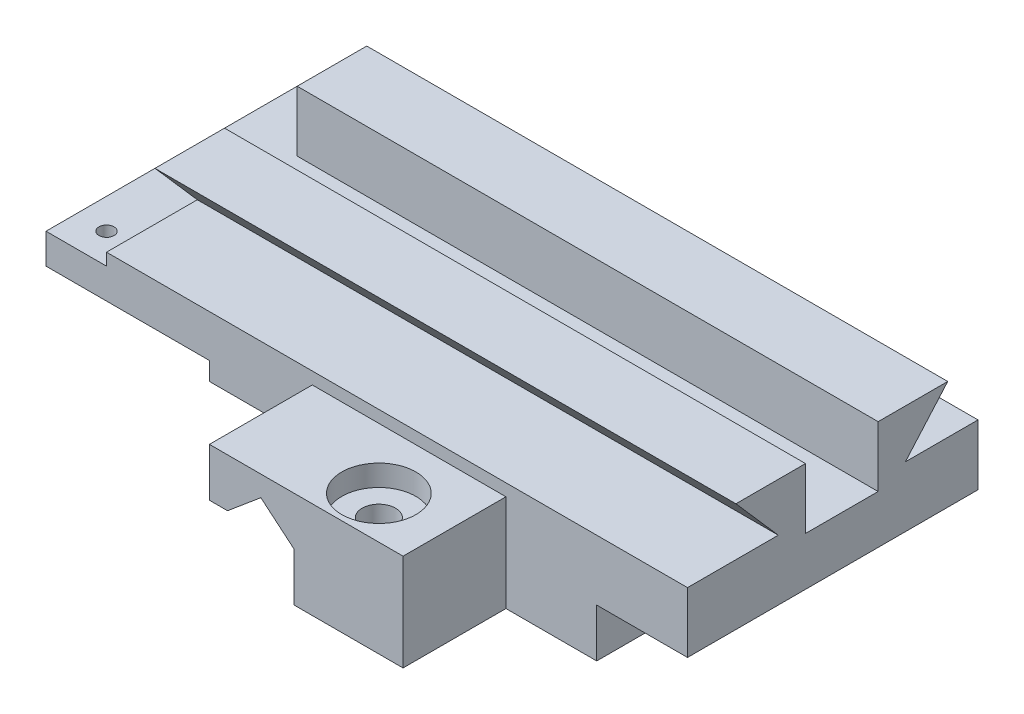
from build123d import *

# Parameters (mm, degrees)
ESTRUSIONE_ESTRUSIONE1_DEPTH                         = 65
SCHIZZO5_W                                           = 44
SCHIZZO5_H                                           = 17
SCHIZZO5_W_2                                         = 30
TAGLIO_ESTRUSIONE1_DEPTH                             = 126.638369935
SCHIZZO6_W                                           = 32
SCHIZZO6_H                                           = 2
TAGLIO_ESTRUSIONE2_DEPTH                             = 17
FORO_LAMATO_PER_BULLONE_M5_A_TESTA_ESAGO_D           = 5.5
FORO_LAMATO_PER_BULLONE_M5_A_TESTA_ESAGO_CBORE_D     = 12.238
FORO_LAMATO_PER_BULLONE_M5_A_TESTA_ESAGO_CBORE_DEPTH = 3.5
FORO_FILETTATO_M3_2_D                                = 2.5
ESTRUSIONE_ESTRUSIONE3_DEPTH                         = 96
TAGLIO_ESTRUSIONE3_REACH                             = 127.244
SCHIZZO13_W                                          = 12
SCHIZZO13_H                                          = 2
FORO_FILETTATO_M4_1_D                                = 3.3
FORO_FILETTATO_M4_1_DEPTH                            = 5.008579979
FORO_FILETTATO_M4_1_TIP                              = 0.991420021


with BuildPart() as part:
    # Schizzo1 → Estrusione-Estrusione1 (new body)
    with BuildSketch(Plane.XY):
        Polygon((0, 0), (27, 0), (27, -3), (47, -3), (52.5, 1.615047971), (58, -3), (58, -11), (91, -11), (91, -3), (106, -3), (106, 7), (10, 7), (10, 5), (0, 5), align=None)
    extrude(amount=ESTRUSIONE_ESTRUSIONE1_DEPTH)

    # Schizzo5 → Taglio-Estrusione1 (cut, through all)
    with BuildSketch(Plane(origin=(0, 7, 0), x_dir=(1, 0, 0), z_dir=(0, 1, 0))):
        with Locations((22, -56.5)):
            Rectangle(SCHIZZO5_W, SCHIZZO5_H)
        with Locations((91, -56.5)):
            Rectangle(SCHIZZO5_W_2, SCHIZZO5_H)
    extrude(amount=-TAGLIO_ESTRUSIONE1_DEPTH, mode=Mode.SUBTRACT)

    # Schizzo6 → Taglio-Estrusione2 (cut)
    with BuildSketch(Plane.XY.offset(65)):
        with Locations((60, 6)):
            Rectangle(SCHIZZO6_W, SCHIZZO6_H)
    extrude(amount=-TAGLIO_ESTRUSIONE2_DEPTH, mode=Mode.SUBTRACT)

    # Foro lamato per Bullone M5 a testa esago (through all)
    with Locations(Plane(origin=(0, 5, 0), x_dir=(1, 0, 0), z_dir=(0, 1, 0))):
        with Locations((65, -58)):
            CounterBoreHole(FORO_LAMATO_PER_BULLONE_M5_A_TESTA_ESAGO_D / 2, FORO_LAMATO_PER_BULLONE_M5_A_TESTA_ESAGO_CBORE_D / 2, FORO_LAMATO_PER_BULLONE_M5_A_TESTA_ESAGO_CBORE_DEPTH)

    # Foro filettato M3-2 (through all)
    with Locations(Plane(origin=(0, 5, 0), x_dir=(1, 0, 0), z_dir=(0, 1, 0))):
        with Locations((5, -5), (5, -43)):
            Hole(FORO_FILETTATO_M3_2_D / 2)

    # Schizzo12 → Estrusione-Estrusione3 (add)
    with BuildSketch(Plane(origin=(106, 0, 0), x_dir=(0, 0, -1), z_dir=(1, 0, 0))):
        Polygon((-28.5, 7), (-28.5, 15), (-40, 15), (-33, 7), align=None)
        Polygon((-16.5, 7), (-16.5, 15), (-5, 15), (-12, 7), align=None)
    extrude(amount=-ESTRUSIONE_ESTRUSIONE3_DEPTH)

    # Schizzo13 → Taglio-Estrusione3 (cut, up to next)
    with BuildSketch(Plane(origin=(106, 0, 0), x_dir=(0, 0, -1), z_dir=(1, 0, 0)), mode=Mode.PRIVATE) as taglio_estrusione3_sk1:
        with Locations((-22.5, 6)):
            Rectangle(SCHIZZO13_W, SCHIZZO13_H)
    taglio_estrusione3_tool1 = extrude(taglio_estrusione3_sk1.sketch, amount=-TAGLIO_ESTRUSIONE3_REACH, mode=Mode.PRIVATE) & part.part
    add(taglio_estrusione3_tool1.solids().sort_by_distance((106, 6, 22.5))[0], mode=Mode.SUBTRACT)

    # Foro filettato M4-1
    with Locations(Plane(origin=(0, -3, 0), x_dir=(-1, 0, 0), z_dir=(0, -1, 0))):
        with Locations((-34, -19), (-34, -31)):
            Hole(FORO_FILETTATO_M4_1_D / 2, depth=FORO_FILETTATO_M4_1_DEPTH)
            with Locations((0, 0, -(FORO_FILETTATO_M4_1_DEPTH + FORO_FILETTATO_M4_1_TIP / 2))):  # 118° drill point
                Cone(0, FORO_FILETTATO_M4_1_D / 2, FORO_FILETTATO_M4_1_TIP, mode=Mode.SUBTRACT)


solid = part.part
